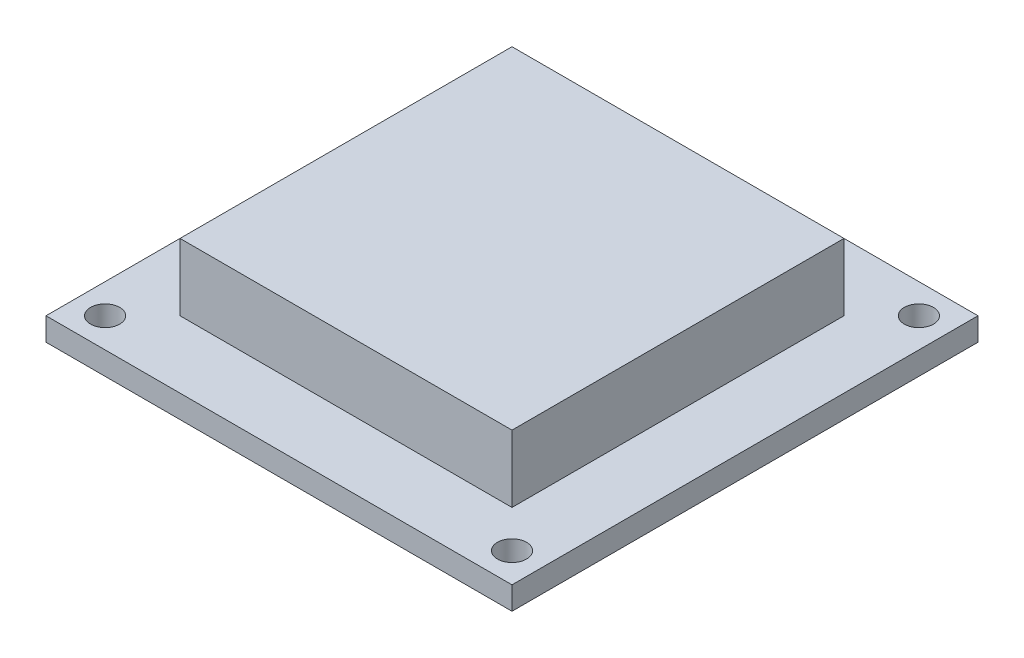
from build123d import *

# Parameters (mm, degrees)
SKETCH1_W           = 16
SKETCH1_H           = 16
BOSS_EXTRUDE1_DEPTH = 0.7874
SKETCH2_W           = 11.4
SKETCH2_H           = 11.4
BOSS_EXTRUDE2_DEPTH = 2.3
SKETCH3_R           = 0.5
CUT_EXTRUDE1_DEPTH  = 12.727405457


with BuildPart() as part:
    # Sketch1 → Boss-Extrude1 (new body)
    with BuildSketch(Plane(origin=(0, 0, 0), x_dir=(1, 0, 0), z_dir=(0, 1, 0))):
        Rectangle(SKETCH1_W, SKETCH1_H)
    extrude(amount=BOSS_EXTRUDE1_DEPTH)

    # Sketch2 → Boss-Extrude2 (add)
    with BuildSketch(Plane(origin=(0, 0.7874, 0), x_dir=(1, 0, 0), z_dir=(0, 1, 0))):
        Rectangle(SKETCH2_W, SKETCH2_H)
    extrude(amount=BOSS_EXTRUDE2_DEPTH)

    # Sketch3 → Cut-Extrude1 (cut, through all)
    with BuildSketch(Plane.XZ):
        with Locations(Location((-6.985, -6.985, 0), (0, 0, 270))):
            Circle(SKETCH3_R)
        with Locations(Location((6.985, -6.985, 0), (0, 0, 270))):
            Circle(SKETCH3_R)
        with Locations(Location((6.985, 6.985, 0), (0, 0, 270))):
            Circle(SKETCH3_R)
        with Locations(Location((-6.985, 6.985, 0), (0, 0, 270))):
            Circle(SKETCH3_R)
    extrude(amount=-CUT_EXTRUDE1_DEPTH, mode=Mode.SUBTRACT)


solid = part.part
